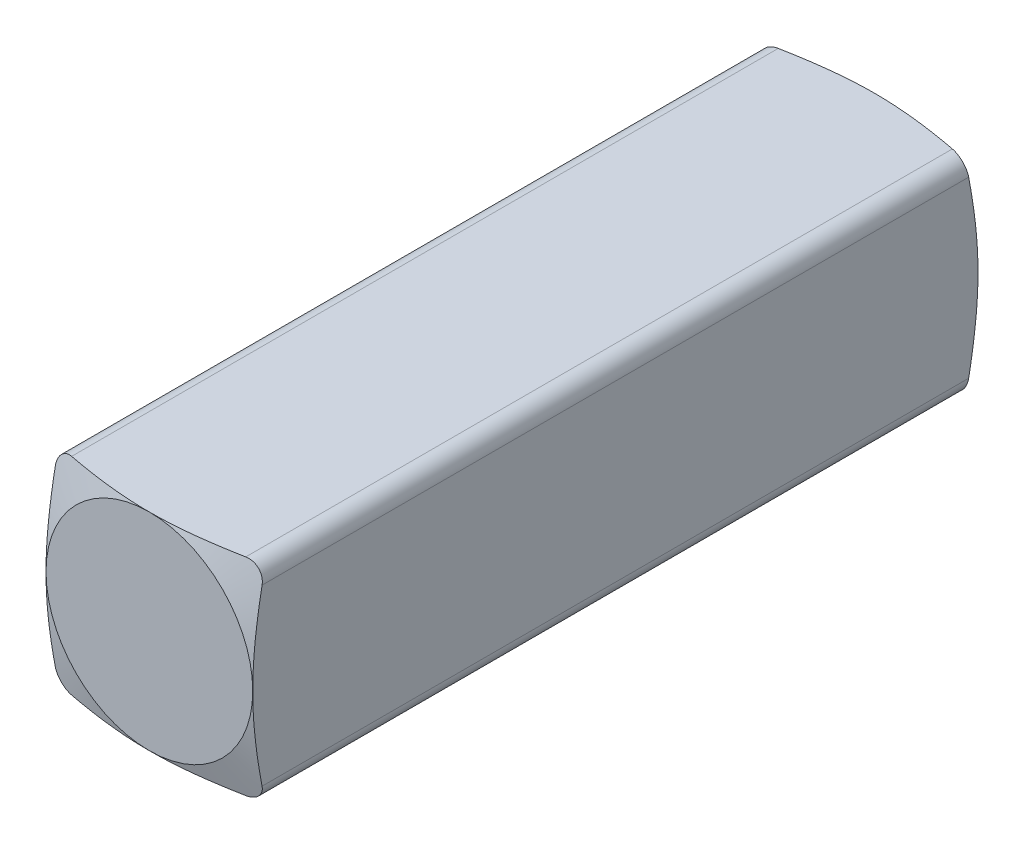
ISO-10303-21;
HEADER;
FILE_DESCRIPTION(('STEP AP214'),'2;1');
FILE_NAME('part.step','',(''),(''),'','','');
FILE_SCHEMA(('AUTOMOTIVE_DESIGN { 1 0 10303 214 1 1 1 1 }'));
ENDSEC;
DATA;
#1=APPLICATION_CONTEXT('core data for automotive mechanical design processes');
#2=APPLICATION_PROTOCOL_DEFINITION('international standard','automotive_design',2000,#1);
#3=PRODUCT_CONTEXT('',#1,'mechanical');
#4=PRODUCT('Part','Part','',(#3));
#5=PRODUCT_RELATED_PRODUCT_CATEGORY('part','',(#4));
#6=PRODUCT_DEFINITION_FORMATION('','',#4);
#7=PRODUCT_DEFINITION_CONTEXT('part definition',#1,'design');
#8=PRODUCT_DEFINITION('design','',#6,#7);
#9=PRODUCT_DEFINITION_SHAPE('','',#8);
#10=(LENGTH_UNIT() NAMED_UNIT(*) SI_UNIT(.MILLI.,.METRE.));
#11=(NAMED_UNIT(*) PLANE_ANGLE_UNIT() SI_UNIT($,.RADIAN.));
#12=(NAMED_UNIT(*) SI_UNIT($,.STERADIAN.) SOLID_ANGLE_UNIT());
#13=UNCERTAINTY_MEASURE_WITH_UNIT(LENGTH_MEASURE(1.E-05),#10,'distance_accuracy_value','');
#14=(GEOMETRIC_REPRESENTATION_CONTEXT(3) GLOBAL_UNCERTAINTY_ASSIGNED_CONTEXT((#13)) GLOBAL_UNIT_ASSIGNED_CONTEXT((#10,
#11,#12)) REPRESENTATION_CONTEXT('',''));
#15=CARTESIAN_POINT('',(0.,0.,0.));
#16=DIRECTION('',(0.,0.,1.));
#17=DIRECTION('',(1.,0.,0.));
#18=AXIS2_PLACEMENT_3D('',#15,#16,#17);
#19=CARTESIAN_POINT('',(-1.53487723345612,-1.585,5.56));
#20=DIRECTION('',(1.,0.,0.));
#21=DIRECTION('',(0.,1.,0.));
#22=AXIS2_PLACEMENT_3D('',#19,#20,#21);
#23=PLANE('',#22);
#24=CARTESIAN_POINT('',(-1.53487723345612,-3.1666652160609,-4.98590212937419));
#25=CARTESIAN_POINT('',(-1.53487723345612,-3.08469064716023,-5.00741349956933));
#26=CARTESIAN_POINT('',(-1.53487723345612,-3.0026760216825,-5.02877253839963));
#27=CARTESIAN_POINT('',(-1.53487723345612,-2.83854664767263,-5.07110881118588));
#28=CARTESIAN_POINT('',(-1.53487723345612,-2.75643189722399,-5.09208603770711));
#29=CARTESIAN_POINT('',(-1.53487723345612,-2.50995900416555,-5.15431622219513));
#30=CARTESIAN_POINT('',(-1.53487723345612,-2.34542557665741,-5.19488001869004));
#31=CARTESIAN_POINT('',(-1.53487723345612,-2.01672815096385,-5.27291274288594));
#32=CARTESIAN_POINT('',(-1.53487723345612,-1.85256851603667,-5.31039979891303));
#33=CARTESIAN_POINT('',(-1.53487723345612,-1.52315459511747,-5.38088405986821));
#34=CARTESIAN_POINT('',(-1.53487723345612,-1.3578996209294,-5.41387809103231));
#35=CARTESIAN_POINT('',(-1.53487723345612,-1.02346692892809,-5.47285926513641));
#36=CARTESIAN_POINT('',(-1.53487723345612,-0.854267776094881,-5.49873220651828));
#37=CARTESIAN_POINT('',(-1.53487723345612,-0.599515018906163,-5.52835962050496));
#38=CARTESIAN_POINT('',(-1.53487723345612,-0.514501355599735,-5.53670232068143));
#39=CARTESIAN_POINT('',(-1.53487723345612,-0.344193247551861,-5.54976964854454));
#40=CARTESIAN_POINT('',(-1.53487723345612,-0.258898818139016,-5.55449447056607));
#41=CARTESIAN_POINT('',(-1.53487723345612,-0.087766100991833,-5.55995909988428));
#42=CARTESIAN_POINT('',(-1.53487723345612,-0.00192717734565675,-5.56067953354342));
#43=CARTESIAN_POINT('',(-1.53487723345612,0.169686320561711,-5.55801863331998));
#44=CARTESIAN_POINT('',(-1.53487723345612,0.255460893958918,-5.55463724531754));
#45=CARTESIAN_POINT('',(-1.53487723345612,0.426896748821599,-5.54405364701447));
#46=CARTESIAN_POINT('',(-1.53487723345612,0.512557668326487,-5.53684572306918));
#47=CARTESIAN_POINT('',(-1.53487723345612,0.68353110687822,-5.51913338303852));
#48=CARTESIAN_POINT('',(-1.53487723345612,0.768843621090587,-5.50862892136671));
#49=CARTESIAN_POINT('',(-1.53487723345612,0.974055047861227,-5.48006689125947));
#50=CARTESIAN_POINT('',(-1.53487723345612,1.09376665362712,-5.46067915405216));
#51=CARTESIAN_POINT('',(-1.53487723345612,1.33251777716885,-5.41809303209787));
#52=CARTESIAN_POINT('',(-1.53487723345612,1.45155714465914,-5.39489382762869));
#53=CARTESIAN_POINT('',(-1.53487723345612,1.68916216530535,-5.34581473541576));
#54=CARTESIAN_POINT('',(-1.53487723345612,1.80772743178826,-5.31993299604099));
#55=CARTESIAN_POINT('',(-1.53487723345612,2.04441891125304,-5.26629444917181));
#56=CARTESIAN_POINT('',(-1.53487723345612,2.1625451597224,-5.23853779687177));
#57=CARTESIAN_POINT('',(-1.53487723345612,2.39875520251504,-5.18161334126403));
#58=CARTESIAN_POINT('',(-1.53487723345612,2.5168382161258,-5.15244231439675));
#59=CARTESIAN_POINT('',(-1.53487723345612,2.75275603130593,-5.09311121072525));
#60=CARTESIAN_POINT('',(-1.53487723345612,2.87059082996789,-5.06295112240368));
#61=CARTESIAN_POINT('',(-1.53487723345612,3.22371274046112,-4.97140632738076));
#62=CARTESIAN_POINT('',(-1.53487723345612,3.45871696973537,-4.90893257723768));
#63=CARTESIAN_POINT('',(-1.53487723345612,3.92636425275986,-4.78280087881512));
#64=CARTESIAN_POINT('',(-1.53487723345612,4.15901102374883,-4.71915660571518));
#65=CARTESIAN_POINT('',(-1.53487723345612,4.62403801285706,-4.5907856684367));
#66=CARTESIAN_POINT('',(-1.53487723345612,4.85641819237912,-4.52605886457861));
#67=CARTESIAN_POINT('',(-1.53487723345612,5.31976447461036,-4.39622957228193));
#68=CARTESIAN_POINT('',(-1.53487723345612,5.55073162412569,-4.33113081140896));
#69=CARTESIAN_POINT('',(-1.53487723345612,6.01248807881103,-4.20042948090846));
#70=CARTESIAN_POINT('',(-1.53487723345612,6.24327740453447,-4.13482698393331));
#71=CARTESIAN_POINT('',(-1.53487723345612,6.47402102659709,-4.06906552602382));
#72=B_SPLINE_CURVE_WITH_KNOTS('',3,(#24,#25,#26,#27,#28,#29,#30,#31,#32,#33,#34,#35,#36,#37,#38,
#39,#40,#41,#42,#43,#44,#45,#46,#47,#48,#49,#50,#51,#52,#53,#54,#55,#56,#57,#58,#59,#60,#61,#62,
#63,#64,#65,#66,#67,#68,#69,#70,#71),.UNSPECIFIED.,.F.,.F.,(4,2,2,2,2,2,2,2,2,2,2,2,2,2,2,2,2,2,
2,2,2,2,2,4),(0.,0.254249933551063,0.508504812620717,1.01686983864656,1.5219847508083,
2.02745463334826,2.54061232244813,2.79681427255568,3.05300245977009,3.31042903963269,
3.56785901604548,3.82567446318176,4.08349347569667,4.44721252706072,4.81100990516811,
5.17506008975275,5.53908017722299,5.90397296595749,6.26887000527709,6.998356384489,
7.72193914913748,8.44561600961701,9.16551335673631,9.8853087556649),.UNSPECIFIED.);
#73=CARTESIAN_POINT('',(-1.53487723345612,0.,-5.56));
#74=VERTEX_POINT('',#73);
#75=CARTESIAN_POINT('',(-1.53487723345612,-1.335,-5.41698643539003));
#76=VERTEX_POINT('',#75);
#77=EDGE_CURVE('E130',#74,#76,#72,.F.);
#78=ORIENTED_EDGE('',*,*,#77,.T.);
#79=DIRECTION('',(0.,0.,-1.));
#80=VECTOR('',#79,1.);
#81=CARTESIAN_POINT('',(-1.53487723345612,-1.335,5.56));
#82=LINE('',#81,#80);
#83=CARTESIAN_POINT('',(-1.53487723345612,-1.335,5.41698643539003));
#84=VERTEX_POINT('',#83);
#85=EDGE_CURVE('E60',#76,#84,#82,.F.);
#86=ORIENTED_EDGE('',*,*,#85,.T.);
#87=CARTESIAN_POINT('',(-1.53487723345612,-3.1666652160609,4.98590212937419));
#88=CARTESIAN_POINT('',(-1.53487723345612,-3.08469064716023,5.00741349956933));
#89=CARTESIAN_POINT('',(-1.53487723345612,-3.0026760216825,5.02877253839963));
#90=CARTESIAN_POINT('',(-1.53487723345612,-2.83854664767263,5.07110881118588));
#91=CARTESIAN_POINT('',(-1.53487723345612,-2.75643189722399,5.09208603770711));
#92=CARTESIAN_POINT('',(-1.53487723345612,-2.50995900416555,5.15431622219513));
#93=CARTESIAN_POINT('',(-1.53487723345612,-2.34542557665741,5.19488001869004));
#94=CARTESIAN_POINT('',(-1.53487723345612,-2.01672815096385,5.27291274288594));
#95=CARTESIAN_POINT('',(-1.53487723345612,-1.85256851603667,5.31039979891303));
#96=CARTESIAN_POINT('',(-1.53487723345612,-1.52315459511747,5.38088405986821));
#97=CARTESIAN_POINT('',(-1.53487723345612,-1.3578996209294,5.41387809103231));
#98=CARTESIAN_POINT('',(-1.53487723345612,-1.02346692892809,5.47285926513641));
#99=CARTESIAN_POINT('',(-1.53487723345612,-0.854267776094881,5.49873220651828));
#100=CARTESIAN_POINT('',(-1.53487723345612,-0.599515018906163,5.52835962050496));
#101=CARTESIAN_POINT('',(-1.53487723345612,-0.514501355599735,5.53670232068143));
#102=CARTESIAN_POINT('',(-1.53487723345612,-0.344193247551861,5.54976964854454));
#103=CARTESIAN_POINT('',(-1.53487723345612,-0.258898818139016,5.55449447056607));
#104=CARTESIAN_POINT('',(-1.53487723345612,-0.087766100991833,5.55995909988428));
#105=CARTESIAN_POINT('',(-1.53487723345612,-0.00192717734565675,5.56067953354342));
#106=CARTESIAN_POINT('',(-1.53487723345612,0.169686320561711,5.55801863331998));
#107=CARTESIAN_POINT('',(-1.53487723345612,0.255460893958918,5.55463724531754));
#108=CARTESIAN_POINT('',(-1.53487723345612,0.426896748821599,5.54405364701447));
#109=CARTESIAN_POINT('',(-1.53487723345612,0.512557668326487,5.53684572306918));
#110=CARTESIAN_POINT('',(-1.53487723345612,0.68353110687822,5.51913338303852));
#111=CARTESIAN_POINT('',(-1.53487723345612,0.768843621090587,5.50862892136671));
#112=CARTESIAN_POINT('',(-1.53487723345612,0.974055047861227,5.48006689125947));
#113=CARTESIAN_POINT('',(-1.53487723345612,1.09376665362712,5.46067915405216));
#114=CARTESIAN_POINT('',(-1.53487723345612,1.33251777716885,5.41809303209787));
#115=CARTESIAN_POINT('',(-1.53487723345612,1.45155714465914,5.39489382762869));
#116=CARTESIAN_POINT('',(-1.53487723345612,1.68916216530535,5.34581473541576));
#117=CARTESIAN_POINT('',(-1.53487723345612,1.80772743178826,5.31993299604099));
#118=CARTESIAN_POINT('',(-1.53487723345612,2.04441891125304,5.26629444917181));
#119=CARTESIAN_POINT('',(-1.53487723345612,2.1625451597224,5.23853779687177));
#120=CARTESIAN_POINT('',(-1.53487723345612,2.39875520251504,5.18161334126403));
#121=CARTESIAN_POINT('',(-1.53487723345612,2.5168382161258,5.15244231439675));
#122=CARTESIAN_POINT('',(-1.53487723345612,2.75275603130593,5.09311121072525));
#123=CARTESIAN_POINT('',(-1.53487723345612,2.87059082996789,5.06295112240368));
#124=CARTESIAN_POINT('',(-1.53487723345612,3.22371274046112,4.97140632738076));
#125=CARTESIAN_POINT('',(-1.53487723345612,3.45871696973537,4.90893257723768));
#126=CARTESIAN_POINT('',(-1.53487723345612,3.92636425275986,4.78280087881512));
#127=CARTESIAN_POINT('',(-1.53487723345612,4.15901102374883,4.71915660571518));
#128=CARTESIAN_POINT('',(-1.53487723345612,4.62403801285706,4.5907856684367));
#129=CARTESIAN_POINT('',(-1.53487723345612,4.85641819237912,4.52605886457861));
#130=CARTESIAN_POINT('',(-1.53487723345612,5.31976447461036,4.39622957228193));
#131=CARTESIAN_POINT('',(-1.53487723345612,5.55073162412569,4.33113081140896));
#132=CARTESIAN_POINT('',(-1.53487723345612,6.01248807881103,4.20042948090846));
#133=CARTESIAN_POINT('',(-1.53487723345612,6.24327740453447,4.13482698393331));
#134=CARTESIAN_POINT('',(-1.53487723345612,6.47402102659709,4.06906552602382));
#135=B_SPLINE_CURVE_WITH_KNOTS('',3,(#87,#88,#89,#90,#91,#92,#93,#94,#95,#96,#97,#98,#99,#100,
#101,#102,#103,#104,#105,#106,#107,#108,#109,#110,#111,#112,#113,#114,#115,#116,#117,#118,#119,
#120,#121,#122,#123,#124,#125,#126,#127,#128,#129,#130,#131,#132,#133,#134),.UNSPECIFIED.,.F.,
.F.,(4,2,2,2,2,2,2,2,2,2,2,2,2,2,2,2,2,2,2,2,2,2,2,4),(0.,0.254249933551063,0.508504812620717,
1.01686983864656,1.5219847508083,2.02745463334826,2.54061232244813,2.79681427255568,
3.05300245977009,3.31042903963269,3.56785901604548,3.82567446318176,4.08349347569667,
4.44721252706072,4.81100990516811,5.17506008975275,5.53908017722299,5.90397296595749,
6.26887000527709,6.998356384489,7.72193914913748,8.44561600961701,9.16551335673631,
9.8853087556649),.UNSPECIFIED.);
#136=CARTESIAN_POINT('',(-1.53487723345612,0.,5.56));
#137=VERTEX_POINT('',#136);
#138=EDGE_CURVE('E457',#84,#137,#135,.T.);
#139=ORIENTED_EDGE('',*,*,#138,.T.);
#140=CARTESIAN_POINT('',(-1.53487723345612,1.33500000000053,5.41698643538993));
#141=VERTEX_POINT('',#140);
#142=EDGE_CURVE('E191',#137,#141,#135,.T.);
#143=ORIENTED_EDGE('',*,*,#142,.T.);
#144=DIRECTION('',(0.,0.,-1.));
#145=VECTOR('',#144,1.);
#146=CARTESIAN_POINT('',(-1.53487723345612,1.335,5.56));
#147=LINE('',#146,#145);
#148=CARTESIAN_POINT('',(-1.53487723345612,1.33500000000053,-5.41698643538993));
#149=VERTEX_POINT('',#148);
#150=EDGE_CURVE('E132',#141,#149,#147,.T.);
#151=ORIENTED_EDGE('',*,*,#150,.T.);
#152=EDGE_CURVE('E128',#149,#74,#72,.F.);
#153=ORIENTED_EDGE('',*,*,#152,.T.);
#154=EDGE_LOOP('',(#78,#86,#139,#143,#151,#153));
#155=FACE_BOUND('',#154,.T.);
#156=ADVANCED_FACE('F34',(#155),#23,.F.);
#157=CARTESIAN_POINT('',(-1.53487723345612,-1.585,5.56));
#158=DIRECTION('',(0.,1.,0.));
#159=DIRECTION('',(-1.,0.,0.));
#160=AXIS2_PLACEMENT_3D('',#157,#158,#159);
#161=PLANE('',#160);
#162=CARTESIAN_POINT('',(-3.11654636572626,-1.585,-4.98590110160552));
#163=CARTESIAN_POINT('',(-3.03457163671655,-1.585,-5.00741251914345));
#164=CARTESIAN_POINT('',(-2.95255685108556,-1.585,-5.02877160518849));
#165=CARTESIAN_POINT('',(-2.78842715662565,-1.585,-5.07110797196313));
#166=CARTESIAN_POINT('',(-2.70631224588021,-1.585,-5.092085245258));
#167=CARTESIAN_POINT('',(-2.45983887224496,-1.585,-5.1543155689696));
#168=CARTESIAN_POINT('',(-2.29530512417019,-1.585,-5.19487945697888));
#169=CARTESIAN_POINT('',(-1.96660706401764,-1.585,-5.27291235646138));
#170=CARTESIAN_POINT('',(-1.80244711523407,-1.585,-5.31039949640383));
#171=CARTESIAN_POINT('',(-1.4730325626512,-1.585,-5.38088391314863));
#172=CARTESIAN_POINT('',(-1.30777727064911,-1.585,-5.41387801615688));
#173=CARTESIAN_POINT('',(-0.973343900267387,-1.585,-5.47285931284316));
#174=CARTESIAN_POINT('',(-0.804144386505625,-1.585,-5.49873230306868));
#175=CARTESIAN_POINT('',(-0.549391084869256,-1.585,-5.5283597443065));
#176=CARTESIAN_POINT('',(-0.464377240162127,-1.585,-5.53670244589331));
#177=CARTESIAN_POINT('',(-0.294068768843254,-1.585,-5.54976975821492));
#178=CARTESIAN_POINT('',(-0.208774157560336,-1.585,-5.55449456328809));
#179=CARTESIAN_POINT('',(-0.0376410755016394,-1.585,-5.55995913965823));
#180=CARTESIAN_POINT('',(0.0481980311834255,-1.585,-5.56067953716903));
#181=CARTESIAN_POINT('',(0.219811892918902,-1.585,-5.55801854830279));
#182=CARTESIAN_POINT('',(0.305586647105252,-1.585,-5.55463710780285));
#183=CARTESIAN_POINT('',(0.477022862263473,-1.585,-5.54405339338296));
#184=CARTESIAN_POINT('',(0.562683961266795,-1.585,-5.53684540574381));
#185=CARTESIAN_POINT('',(0.733657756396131,-1.585,-5.51913293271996));
#186=CARTESIAN_POINT('',(0.818970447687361,-1.585,-5.5086284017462));
#187=CARTESIAN_POINT('',(1.02418204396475,-1.585,-5.48006623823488));
#188=CARTESIAN_POINT('',(1.14389364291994,-1.585,-5.46067844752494));
#189=CARTESIAN_POINT('',(1.38264475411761,-1.585,-5.41809223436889));
#190=CARTESIAN_POINT('',(1.50168411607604,-1.585,-5.39489299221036));
#191=CARTESIAN_POINT('',(1.73928912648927,-1.585,-5.34581383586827));
#192=CARTESIAN_POINT('',(1.85785438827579,-1.585,-5.31993207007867));
#193=CARTESIAN_POINT('',(2.09454585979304,-1.585,-5.26629347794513));
#194=CARTESIAN_POINT('',(2.21267210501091,-1.585,-5.23853680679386));
#195=CARTESIAN_POINT('',(2.44888213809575,-1.585,-5.18161231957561));
#196=CARTESIAN_POINT('',(2.56696514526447,-1.585,-5.15244128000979));
#197=CARTESIAN_POINT('',(2.80288294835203,-1.585,-5.09311015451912));
#198=CARTESIAN_POINT('',(2.92071774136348,-1.585,-5.06295005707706));
#199=CARTESIAN_POINT('',(3.27383963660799,-1.585,-4.97140523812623));
#200=CARTESIAN_POINT('',(3.50884385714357,-1.585,-4.90893147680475));
#201=CARTESIAN_POINT('',(3.97649110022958,-1.585,-4.78279976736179));
#202=CARTESIAN_POINT('',(4.20913784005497,-1.585,-4.71915549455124));
#203=CARTESIAN_POINT('',(4.67416476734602,-1.585,-4.59078456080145));
#204=CARTESIAN_POINT('',(4.9065449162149,-1.585,-4.52605776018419));
#205=CARTESIAN_POINT('',(5.36989115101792,-1.585,-4.39622847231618));
#206=CARTESIAN_POINT('',(5.60085828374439,-1.585,-4.33112971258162));
#207=CARTESIAN_POINT('',(6.06261470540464,-1.585,-4.2004283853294));
#208=CARTESIAN_POINT('',(6.29340401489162,-1.585,-4.13482589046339));
#209=CARTESIAN_POINT('',(6.52414762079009,-1.585,-4.06906443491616));
#210=B_SPLINE_CURVE_WITH_KNOTS('',3,(#162,#163,#164,#165,#166,#167,#168,#169,#170,#171,#172,
#173,#174,#175,#176,#177,#178,#179,#180,#181,#182,#183,#184,#185,#186,#187,#188,#189,#190,#191,
#192,#193,#194,#195,#196,#197,#198,#199,#200,#201,#202,#203,#204,#205,#206,#207,#208,#209),
.UNSPECIFIED.,.F.,.F.,(4,2,2,2,2,2,2,2,2,2,2,2,2,2,2,2,2,2,2,2,2,2,2,4),(0.,0.254250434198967,
0.508505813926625,1.0168718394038,1.52198772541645,2.02745858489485,2.54061736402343,
2.79681985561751,3.05300858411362,3.31043571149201,3.56786623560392,3.82568223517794,
4.08350180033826,4.44722085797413,4.81101824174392,5.17506842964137,5.53908852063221,
5.90398129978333,6.26887832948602,6.99836469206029,7.72194736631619,8.44562413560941,
9.16552143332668,9.88531678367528),.UNSPECIFIED.);
#211=CARTESIAN_POINT('',(0.0501227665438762,-1.585,-5.56));
#212=VERTEX_POINT('',#211);
#213=CARTESIAN_POINT('',(1.38512276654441,-1.585,-5.41698643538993));
#214=VERTEX_POINT('',#213);
#215=EDGE_CURVE('E212',#212,#214,#210,.T.);
#216=ORIENTED_EDGE('',*,*,#215,.T.);
#217=DIRECTION('',(0.,0.,-1.));
#218=VECTOR('',#217,1.);
#219=CARTESIAN_POINT('',(1.38512276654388,-1.585,5.56));
#220=LINE('',#219,#218);
#221=CARTESIAN_POINT('',(1.38512276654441,-1.585,5.41698643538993));
#222=VERTEX_POINT('',#221);
#223=EDGE_CURVE('E430',#214,#222,#220,.F.);
#224=ORIENTED_EDGE('',*,*,#223,.T.);
#225=CARTESIAN_POINT('',(-3.11654636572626,-1.585,4.98590110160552));
#226=CARTESIAN_POINT('',(-3.03457163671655,-1.585,5.00741251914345));
#227=CARTESIAN_POINT('',(-2.95255685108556,-1.585,5.02877160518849));
#228=CARTESIAN_POINT('',(-2.78842715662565,-1.585,5.07110797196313));
#229=CARTESIAN_POINT('',(-2.70631224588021,-1.585,5.092085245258));
#230=CARTESIAN_POINT('',(-2.45983887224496,-1.585,5.1543155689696));
#231=CARTESIAN_POINT('',(-2.29530512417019,-1.585,5.19487945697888));
#232=CARTESIAN_POINT('',(-1.96660706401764,-1.585,5.27291235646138));
#233=CARTESIAN_POINT('',(-1.80244711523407,-1.585,5.31039949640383));
#234=CARTESIAN_POINT('',(-1.4730325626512,-1.585,5.38088391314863));
#235=CARTESIAN_POINT('',(-1.30777727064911,-1.585,5.41387801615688));
#236=CARTESIAN_POINT('',(-0.973343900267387,-1.585,5.47285931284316));
#237=CARTESIAN_POINT('',(-0.804144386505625,-1.585,5.49873230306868));
#238=CARTESIAN_POINT('',(-0.549391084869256,-1.585,5.5283597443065));
#239=CARTESIAN_POINT('',(-0.464377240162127,-1.585,5.53670244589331));
#240=CARTESIAN_POINT('',(-0.294068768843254,-1.585,5.54976975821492));
#241=CARTESIAN_POINT('',(-0.208774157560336,-1.585,5.55449456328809));
#242=CARTESIAN_POINT('',(-0.0376410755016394,-1.585,5.55995913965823));
#243=CARTESIAN_POINT('',(0.0481980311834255,-1.585,5.56067953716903));
#244=CARTESIAN_POINT('',(0.219811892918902,-1.585,5.55801854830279));
#245=CARTESIAN_POINT('',(0.305586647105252,-1.585,5.55463710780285));
#246=CARTESIAN_POINT('',(0.477022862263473,-1.585,5.54405339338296));
#247=CARTESIAN_POINT('',(0.562683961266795,-1.585,5.53684540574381));
#248=CARTESIAN_POINT('',(0.733657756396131,-1.585,5.51913293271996));
#249=CARTESIAN_POINT('',(0.818970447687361,-1.585,5.5086284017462));
#250=CARTESIAN_POINT('',(1.02418204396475,-1.585,5.48006623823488));
#251=CARTESIAN_POINT('',(1.14389364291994,-1.585,5.46067844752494));
#252=CARTESIAN_POINT('',(1.38264475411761,-1.585,5.41809223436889));
#253=CARTESIAN_POINT('',(1.50168411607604,-1.585,5.39489299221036));
#254=CARTESIAN_POINT('',(1.73928912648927,-1.585,5.34581383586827));
#255=CARTESIAN_POINT('',(1.85785438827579,-1.585,5.31993207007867));
#256=CARTESIAN_POINT('',(2.09454585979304,-1.585,5.26629347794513));
#257=CARTESIAN_POINT('',(2.21267210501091,-1.585,5.23853680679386));
#258=CARTESIAN_POINT('',(2.44888213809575,-1.585,5.18161231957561));
#259=CARTESIAN_POINT('',(2.56696514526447,-1.585,5.15244128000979));
#260=CARTESIAN_POINT('',(2.80288294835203,-1.585,5.09311015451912));
#261=CARTESIAN_POINT('',(2.92071774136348,-1.585,5.06295005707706));
#262=CARTESIAN_POINT('',(3.27383963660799,-1.585,4.97140523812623));
#263=CARTESIAN_POINT('',(3.50884385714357,-1.585,4.90893147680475));
#264=CARTESIAN_POINT('',(3.97649110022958,-1.585,4.78279976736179));
#265=CARTESIAN_POINT('',(4.20913784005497,-1.585,4.71915549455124));
#266=CARTESIAN_POINT('',(4.67416476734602,-1.585,4.59078456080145));
#267=CARTESIAN_POINT('',(4.9065449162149,-1.585,4.52605776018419));
#268=CARTESIAN_POINT('',(5.36989115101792,-1.585,4.39622847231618));
#269=CARTESIAN_POINT('',(5.60085828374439,-1.585,4.33112971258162));
#270=CARTESIAN_POINT('',(6.06261470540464,-1.585,4.2004283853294));
#271=CARTESIAN_POINT('',(6.29340401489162,-1.585,4.13482589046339));
#272=CARTESIAN_POINT('',(6.52414762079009,-1.585,4.06906443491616));
#273=B_SPLINE_CURVE_WITH_KNOTS('',3,(#225,#226,#227,#228,#229,#230,#231,#232,#233,#234,#235,
#236,#237,#238,#239,#240,#241,#242,#243,#244,#245,#246,#247,#248,#249,#250,#251,#252,#253,#254,
#255,#256,#257,#258,#259,#260,#261,#262,#263,#264,#265,#266,#267,#268,#269,#270,#271,#272),
.UNSPECIFIED.,.F.,.F.,(4,2,2,2,2,2,2,2,2,2,2,2,2,2,2,2,2,2,2,2,2,2,2,4),(0.,0.254250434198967,
0.508505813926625,1.0168718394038,1.52198772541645,2.02745858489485,2.54061736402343,
2.79681985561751,3.05300858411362,3.31043571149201,3.56786623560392,3.82568223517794,
4.08350180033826,4.44722085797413,4.81101824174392,5.17506842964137,5.53908852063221,
5.90398129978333,6.26887832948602,6.99836469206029,7.72194736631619,8.44562413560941,
9.16552143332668,9.88531678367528),.UNSPECIFIED.);
#274=CARTESIAN_POINT('',(0.0501227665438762,-1.585,5.56));
#275=VERTEX_POINT('',#274);
#276=EDGE_CURVE('E178',#222,#275,#273,.F.);
#277=ORIENTED_EDGE('',*,*,#276,.T.);
#278=CARTESIAN_POINT('',(-1.28487723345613,-1.585,5.41698643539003));
#279=VERTEX_POINT('',#278);
#280=EDGE_CURVE('E180',#275,#279,#273,.F.);
#281=ORIENTED_EDGE('',*,*,#280,.T.);
#282=DIRECTION('',(0.,0.,-1.));
#283=VECTOR('',#282,1.);
#284=CARTESIAN_POINT('',(-1.28487723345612,-1.585,5.56));
#285=LINE('',#284,#283);
#286=CARTESIAN_POINT('',(-1.28487723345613,-1.585,-5.41698643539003));
#287=VERTEX_POINT('',#286);
#288=EDGE_CURVE('E435',#279,#287,#285,.T.);
#289=ORIENTED_EDGE('',*,*,#288,.T.);
#290=EDGE_CURVE('E145',#287,#212,#210,.T.);
#291=ORIENTED_EDGE('',*,*,#290,.T.);
#292=EDGE_LOOP('',(#216,#224,#277,#281,#289,#291));
#293=FACE_BOUND('',#292,.T.);
#294=ADVANCED_FACE('F201',(#293),#161,.F.);
#295=CARTESIAN_POINT('',(1.63512276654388,-1.585,5.56));
#296=DIRECTION('',(-1.,0.,0.));
#297=DIRECTION('',(0.,-1.,0.));
#298=AXIS2_PLACEMENT_3D('',#295,#296,#297);
#299=PLANE('',#298);
#300=CARTESIAN_POINT('',(1.63512276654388,-3.16666913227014,-4.98590110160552));
#301=CARTESIAN_POINT('',(1.63512276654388,-3.08469440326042,-5.00741251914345));
#302=CARTESIAN_POINT('',(1.63512276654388,-3.00267961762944,-5.02877160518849));
#303=CARTESIAN_POINT('',(1.63512276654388,-2.83854992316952,-5.07110797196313));
#304=CARTESIAN_POINT('',(1.63512276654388,-2.75643501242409,-5.092085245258));
#305=CARTESIAN_POINT('',(1.63512276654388,-2.50996163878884,-5.1543155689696));
#306=CARTESIAN_POINT('',(1.63512276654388,-2.34542789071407,-5.19487945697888));
#307=CARTESIAN_POINT('',(1.63512276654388,-2.01672983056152,-5.27291235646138));
#308=CARTESIAN_POINT('',(1.63512276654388,-1.85256988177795,-5.31039949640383));
#309=CARTESIAN_POINT('',(1.63512276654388,-1.52315532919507,-5.38088391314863));
#310=CARTESIAN_POINT('',(1.63512276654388,-1.35790003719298,-5.41387801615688));
#311=CARTESIAN_POINT('',(1.63512276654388,-1.02346666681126,-5.47285931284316));
#312=CARTESIAN_POINT('',(1.63512276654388,-0.854267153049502,-5.49873230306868));
#313=CARTESIAN_POINT('',(1.63512276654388,-0.599513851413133,-5.5283597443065));
#314=CARTESIAN_POINT('',(1.63512276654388,-0.514500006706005,-5.53670244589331));
#315=CARTESIAN_POINT('',(1.63512276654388,-0.344191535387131,-5.54976975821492));
#316=CARTESIAN_POINT('',(1.63512276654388,-0.258896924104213,-5.55449456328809));
#317=CARTESIAN_POINT('',(1.63512276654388,-0.0877638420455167,-5.55995913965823));
#318=CARTESIAN_POINT('',(1.63512276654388,-0.00192473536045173,-5.56067953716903));
#319=CARTESIAN_POINT('',(1.63512276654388,0.169689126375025,-5.55801854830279));
#320=CARTESIAN_POINT('',(1.63512276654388,0.255463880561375,-5.55463710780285));
#321=CARTESIAN_POINT('',(1.63512276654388,0.426900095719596,-5.54405339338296));
#322=CARTESIAN_POINT('',(1.63512276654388,0.512561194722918,-5.53684540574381));
#323=CARTESIAN_POINT('',(1.63512276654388,0.683534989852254,-5.51913293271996));
#324=CARTESIAN_POINT('',(1.63512276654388,0.768847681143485,-5.5086284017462));
#325=CARTESIAN_POINT('',(1.63512276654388,0.974059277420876,-5.48006623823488));
#326=CARTESIAN_POINT('',(1.63512276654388,1.09377087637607,-5.46067844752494));
#327=CARTESIAN_POINT('',(1.63512276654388,1.33252198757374,-5.41809223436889));
#328=CARTESIAN_POINT('',(1.63512276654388,1.45156134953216,-5.39489299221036));
#329=CARTESIAN_POINT('',(1.63512276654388,1.68916635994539,-5.34581383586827));
#330=CARTESIAN_POINT('',(1.63512276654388,1.80773162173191,-5.31993207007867));
#331=CARTESIAN_POINT('',(1.63512276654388,2.04442309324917,-5.26629347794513));
#332=CARTESIAN_POINT('',(1.63512276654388,2.16254933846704,-5.23853680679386));
#333=CARTESIAN_POINT('',(1.63512276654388,2.39875937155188,-5.18161231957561));
#334=CARTESIAN_POINT('',(1.63512276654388,2.5168423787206,-5.15244128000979));
#335=CARTESIAN_POINT('',(1.63512276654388,2.75276018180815,-5.09311015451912));
#336=CARTESIAN_POINT('',(1.63512276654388,2.8705949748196,-5.06295005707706));
#337=CARTESIAN_POINT('',(1.63512276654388,3.22371687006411,-4.97140523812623));
#338=CARTESIAN_POINT('',(1.63512276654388,3.4587210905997,-4.90893147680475));
#339=CARTESIAN_POINT('',(1.63512276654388,3.92636833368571,-4.78279976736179));
#340=CARTESIAN_POINT('',(1.63512276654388,4.1590150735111,-4.71915549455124));
#341=CARTESIAN_POINT('',(1.63512276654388,4.62404200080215,-4.59078456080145));
#342=CARTESIAN_POINT('',(1.63512276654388,4.85642214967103,-4.52605776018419));
#343=CARTESIAN_POINT('',(1.63512276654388,5.31976838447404,-4.39622847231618));
#344=CARTESIAN_POINT('',(1.63512276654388,5.55073551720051,-4.33112971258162));
#345=CARTESIAN_POINT('',(1.63512276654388,6.01249193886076,-4.2004283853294));
#346=CARTESIAN_POINT('',(1.63512276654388,6.24328124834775,-4.13482589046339));
#347=CARTESIAN_POINT('',(1.63512276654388,6.47402485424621,-4.06906443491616));
#348=B_SPLINE_CURVE_WITH_KNOTS('',3,(#300,#301,#302,#303,#304,#305,#306,#307,#308,#309,#310,
#311,#312,#313,#314,#315,#316,#317,#318,#319,#320,#321,#322,#323,#324,#325,#326,#327,#328,#329,
#330,#331,#332,#333,#334,#335,#336,#337,#338,#339,#340,#341,#342,#343,#344,#345,#346,#347),
.UNSPECIFIED.,.F.,.F.,(4,2,2,2,2,2,2,2,2,2,2,2,2,2,2,2,2,2,2,2,2,2,2,4),(0.,0.254250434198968,
0.508505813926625,1.0168718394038,1.52198772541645,2.02745858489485,2.54061736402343,
2.79681985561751,3.05300858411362,3.31043571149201,3.56786623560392,3.82568223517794,
4.08350180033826,4.44722085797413,4.81101824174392,5.17506842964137,5.53908852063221,
5.90398129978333,6.26887832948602,6.99836469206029,7.72194736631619,8.44562413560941,
9.16552143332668,9.88531678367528),.UNSPECIFIED.);
#349=CARTESIAN_POINT('',(1.63512276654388,0.,-5.56));
#350=VERTEX_POINT('',#349);
#351=CARTESIAN_POINT('',(1.63512276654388,1.33500000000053,-5.41698643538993));
#352=VERTEX_POINT('',#351);
#353=EDGE_CURVE('E219',#350,#352,#348,.T.);
#354=ORIENTED_EDGE('',*,*,#353,.T.);
#355=DIRECTION('',(0.,0.,-1.));
#356=VECTOR('',#355,1.);
#357=CARTESIAN_POINT('',(1.63512276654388,1.335,5.56));
#358=LINE('',#357,#356);
#359=CARTESIAN_POINT('',(1.63512276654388,1.33500000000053,5.41698643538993));
#360=VERTEX_POINT('',#359);
#361=EDGE_CURVE('E441',#352,#360,#358,.F.);
#362=ORIENTED_EDGE('',*,*,#361,.T.);
#363=CARTESIAN_POINT('',(1.63512276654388,-3.16666913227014,4.98590110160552));
#364=CARTESIAN_POINT('',(1.63512276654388,-3.08469440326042,5.00741251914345));
#365=CARTESIAN_POINT('',(1.63512276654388,-3.00267961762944,5.02877160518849));
#366=CARTESIAN_POINT('',(1.63512276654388,-2.83854992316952,5.07110797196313));
#367=CARTESIAN_POINT('',(1.63512276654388,-2.75643501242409,5.092085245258));
#368=CARTESIAN_POINT('',(1.63512276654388,-2.50996163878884,5.1543155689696));
#369=CARTESIAN_POINT('',(1.63512276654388,-2.34542789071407,5.19487945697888));
#370=CARTESIAN_POINT('',(1.63512276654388,-2.01672983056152,5.27291235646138));
#371=CARTESIAN_POINT('',(1.63512276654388,-1.85256988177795,5.31039949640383));
#372=CARTESIAN_POINT('',(1.63512276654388,-1.52315532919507,5.38088391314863));
#373=CARTESIAN_POINT('',(1.63512276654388,-1.35790003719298,5.41387801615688));
#374=CARTESIAN_POINT('',(1.63512276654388,-1.02346666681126,5.47285931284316));
#375=CARTESIAN_POINT('',(1.63512276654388,-0.854267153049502,5.49873230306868));
#376=CARTESIAN_POINT('',(1.63512276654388,-0.599513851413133,5.5283597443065));
#377=CARTESIAN_POINT('',(1.63512276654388,-0.514500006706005,5.53670244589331));
#378=CARTESIAN_POINT('',(1.63512276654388,-0.344191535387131,5.54976975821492));
#379=CARTESIAN_POINT('',(1.63512276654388,-0.258896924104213,5.55449456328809));
#380=CARTESIAN_POINT('',(1.63512276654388,-0.0877638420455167,5.55995913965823));
#381=CARTESIAN_POINT('',(1.63512276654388,-0.00192473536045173,5.56067953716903));
#382=CARTESIAN_POINT('',(1.63512276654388,0.169689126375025,5.55801854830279));
#383=CARTESIAN_POINT('',(1.63512276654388,0.255463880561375,5.55463710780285));
#384=CARTESIAN_POINT('',(1.63512276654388,0.426900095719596,5.54405339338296));
#385=CARTESIAN_POINT('',(1.63512276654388,0.512561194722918,5.53684540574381));
#386=CARTESIAN_POINT('',(1.63512276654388,0.683534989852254,5.51913293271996));
#387=CARTESIAN_POINT('',(1.63512276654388,0.768847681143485,5.5086284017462));
#388=CARTESIAN_POINT('',(1.63512276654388,0.974059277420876,5.48006623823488));
#389=CARTESIAN_POINT('',(1.63512276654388,1.09377087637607,5.46067844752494));
#390=CARTESIAN_POINT('',(1.63512276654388,1.33252198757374,5.41809223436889));
#391=CARTESIAN_POINT('',(1.63512276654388,1.45156134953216,5.39489299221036));
#392=CARTESIAN_POINT('',(1.63512276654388,1.68916635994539,5.34581383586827));
#393=CARTESIAN_POINT('',(1.63512276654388,1.80773162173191,5.31993207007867));
#394=CARTESIAN_POINT('',(1.63512276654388,2.04442309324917,5.26629347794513));
#395=CARTESIAN_POINT('',(1.63512276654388,2.16254933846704,5.23853680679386));
#396=CARTESIAN_POINT('',(1.63512276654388,2.39875937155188,5.18161231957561));
#397=CARTESIAN_POINT('',(1.63512276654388,2.5168423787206,5.15244128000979));
#398=CARTESIAN_POINT('',(1.63512276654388,2.75276018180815,5.09311015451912));
#399=CARTESIAN_POINT('',(1.63512276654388,2.8705949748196,5.06295005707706));
#400=CARTESIAN_POINT('',(1.63512276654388,3.22371687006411,4.97140523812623));
#401=CARTESIAN_POINT('',(1.63512276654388,3.4587210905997,4.90893147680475));
#402=CARTESIAN_POINT('',(1.63512276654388,3.92636833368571,4.78279976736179));
#403=CARTESIAN_POINT('',(1.63512276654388,4.1590150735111,4.71915549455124));
#404=CARTESIAN_POINT('',(1.63512276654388,4.62404200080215,4.59078456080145));
#405=CARTESIAN_POINT('',(1.63512276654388,4.85642214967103,4.52605776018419));
#406=CARTESIAN_POINT('',(1.63512276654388,5.31976838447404,4.39622847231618));
#407=CARTESIAN_POINT('',(1.63512276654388,5.55073551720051,4.33112971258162));
#408=CARTESIAN_POINT('',(1.63512276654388,6.01249193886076,4.2004283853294));
#409=CARTESIAN_POINT('',(1.63512276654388,6.24328124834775,4.13482589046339));
#410=CARTESIAN_POINT('',(1.63512276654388,6.47402485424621,4.06906443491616));
#411=B_SPLINE_CURVE_WITH_KNOTS('',3,(#363,#364,#365,#366,#367,#368,#369,#370,#371,#372,#373,
#374,#375,#376,#377,#378,#379,#380,#381,#382,#383,#384,#385,#386,#387,#388,#389,#390,#391,#392,
#393,#394,#395,#396,#397,#398,#399,#400,#401,#402,#403,#404,#405,#406,#407,#408,#409,#410),
.UNSPECIFIED.,.F.,.F.,(4,2,2,2,2,2,2,2,2,2,2,2,2,2,2,2,2,2,2,2,2,2,2,4),(0.,0.254250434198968,
0.508505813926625,1.0168718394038,1.52198772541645,2.02745858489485,2.54061736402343,
2.79681985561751,3.05300858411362,3.31043571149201,3.56786623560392,3.82568223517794,
4.08350180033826,4.44722085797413,4.81101824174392,5.17506842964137,5.53908852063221,
5.90398129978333,6.26887832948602,6.99836469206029,7.72194736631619,8.44562413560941,
9.16552143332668,9.88531678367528),.UNSPECIFIED.);
#412=CARTESIAN_POINT('',(1.63512276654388,0.,5.56));
#413=VERTEX_POINT('',#412);
#414=EDGE_CURVE('E455',#360,#413,#411,.F.);
#415=ORIENTED_EDGE('',*,*,#414,.T.);
#416=CARTESIAN_POINT('',(1.63512276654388,-1.335,5.41698643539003));
#417=VERTEX_POINT('',#416);
#418=EDGE_CURVE('E185',#413,#417,#411,.F.);
#419=ORIENTED_EDGE('',*,*,#418,.T.);
#420=DIRECTION('',(0.,0.,-1.));
#421=VECTOR('',#420,1.);
#422=CARTESIAN_POINT('',(1.63512276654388,-1.335,5.56));
#423=LINE('',#422,#421);
#424=CARTESIAN_POINT('',(1.63512276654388,-1.335,-5.41698643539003));
#425=VERTEX_POINT('',#424);
#426=EDGE_CURVE('E432',#417,#425,#423,.T.);
#427=ORIENTED_EDGE('',*,*,#426,.T.);
#428=EDGE_CURVE('E218',#425,#350,#348,.T.);
#429=ORIENTED_EDGE('',*,*,#428,.T.);
#430=EDGE_LOOP('',(#354,#362,#415,#419,#427,#429));
#431=FACE_BOUND('',#430,.T.);
#432=ADVANCED_FACE('F205',(#431),#299,.F.);
#433=CARTESIAN_POINT('',(-1.53487723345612,1.585,5.56));
#434=DIRECTION('',(0.,-1.,0.));
#435=DIRECTION('',(1.,0.,0.));
#436=AXIS2_PLACEMENT_3D('',#433,#434,#435);
#437=PLANE('',#436);
#438=CARTESIAN_POINT('',(-3.11654244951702,1.585,4.98590212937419));
#439=CARTESIAN_POINT('',(-3.03456788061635,1.585,5.00741349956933));
#440=CARTESIAN_POINT('',(-2.95255325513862,1.585,5.02877253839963));
#441=CARTESIAN_POINT('',(-2.78842388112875,1.585,5.07110881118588));
#442=CARTESIAN_POINT('',(-2.70630913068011,1.585,5.09208603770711));
#443=CARTESIAN_POINT('',(-2.45983623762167,1.585,5.15431622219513));
#444=CARTESIAN_POINT('',(-2.29530281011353,1.585,5.19488001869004));
#445=CARTESIAN_POINT('',(-1.96660538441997,1.585,5.27291274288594));
#446=CARTESIAN_POINT('',(-1.80244574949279,1.585,5.31039979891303));
#447=CARTESIAN_POINT('',(-1.47303182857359,1.585,5.38088405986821));
#448=CARTESIAN_POINT('',(-1.30777685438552,1.585,5.41387809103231));
#449=CARTESIAN_POINT('',(-0.973344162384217,1.585,5.47285926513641));
#450=CARTESIAN_POINT('',(-0.804145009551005,1.585,5.49873220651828));
#451=CARTESIAN_POINT('',(-0.549392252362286,1.585,5.52835962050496));
#452=CARTESIAN_POINT('',(-0.464378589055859,1.585,5.53670232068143));
#453=CARTESIAN_POINT('',(-0.294070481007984,1.585,5.54976964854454));
#454=CARTESIAN_POINT('',(-0.20877605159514,1.585,5.55449447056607));
#455=CARTESIAN_POINT('',(-0.0376433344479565,1.585,5.55995909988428));
#456=CARTESIAN_POINT('',(0.0481955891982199,1.585,5.56067953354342));
#457=CARTESIAN_POINT('',(0.219809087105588,1.585,5.55801863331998));
#458=CARTESIAN_POINT('',(0.305583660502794,1.585,5.55463724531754));
#459=CARTESIAN_POINT('',(0.477019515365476,1.585,5.54405364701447));
#460=CARTESIAN_POINT('',(0.562680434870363,1.585,5.53684572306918));
#461=CARTESIAN_POINT('',(0.733653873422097,1.585,5.51913338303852));
#462=CARTESIAN_POINT('',(0.818966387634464,1.585,5.50862892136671));
#463=CARTESIAN_POINT('',(1.0241778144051,1.585,5.48006689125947));
#464=CARTESIAN_POINT('',(1.143889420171,1.585,5.46067915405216));
#465=CARTESIAN_POINT('',(1.38264054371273,1.585,5.41809303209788));
#466=CARTESIAN_POINT('',(1.50167991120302,1.585,5.39489382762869));
#467=CARTESIAN_POINT('',(1.73928493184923,1.585,5.34581473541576));
#468=CARTESIAN_POINT('',(1.85785019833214,1.585,5.31993299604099));
#469=CARTESIAN_POINT('',(2.09454167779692,1.585,5.26629444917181));
#470=CARTESIAN_POINT('',(2.21266792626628,1.585,5.23853779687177));
#471=CARTESIAN_POINT('',(2.44887796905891,1.585,5.18161334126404));
#472=CARTESIAN_POINT('',(2.56696098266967,1.585,5.15244231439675));
#473=CARTESIAN_POINT('',(2.80287879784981,1.585,5.09311121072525));
#474=CARTESIAN_POINT('',(2.92071359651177,1.585,5.06295112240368));
#475=CARTESIAN_POINT('',(3.273835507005,1.585,4.97140632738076));
#476=CARTESIAN_POINT('',(3.50883973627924,1.585,4.90893257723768));
#477=CARTESIAN_POINT('',(3.97648701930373,1.585,4.78280087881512));
#478=CARTESIAN_POINT('',(4.20913379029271,1.585,4.71915660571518));
#479=CARTESIAN_POINT('',(4.67416077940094,1.585,4.5907856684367));
#480=CARTESIAN_POINT('',(4.906540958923,1.585,4.52605886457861));
#481=CARTESIAN_POINT('',(5.36988724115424,1.585,4.39622957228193));
#482=CARTESIAN_POINT('',(5.60085439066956,1.585,4.33113081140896));
#483=CARTESIAN_POINT('',(6.06261084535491,1.585,4.20042948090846));
#484=CARTESIAN_POINT('',(6.29340017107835,1.585,4.13482698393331));
#485=CARTESIAN_POINT('',(6.52414379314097,1.585,4.06906552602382));
#486=B_SPLINE_CURVE_WITH_KNOTS('',3,(#438,#439,#440,#441,#442,#443,#444,#445,#446,#447,#448,
#449,#450,#451,#452,#453,#454,#455,#456,#457,#458,#459,#460,#461,#462,#463,#464,#465,#466,#467,
#468,#469,#470,#471,#472,#473,#474,#475,#476,#477,#478,#479,#480,#481,#482,#483,#484,#485),
.UNSPECIFIED.,.F.,.F.,(4,2,2,2,2,2,2,2,2,2,2,2,2,2,2,2,2,2,2,2,2,2,2,4),(0.,0.254249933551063,
0.508504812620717,1.01686983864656,1.5219847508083,2.02745463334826,2.54061232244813,
2.79681427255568,3.05300245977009,3.31042903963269,3.56785901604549,3.82567446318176,
4.08349347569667,4.44721252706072,4.81100990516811,5.17506008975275,5.53908017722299,
5.90397296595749,6.26887000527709,6.998356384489,7.72193914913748,8.44561600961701,
9.16551335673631,9.8853087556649),.UNSPECIFIED.);
#487=CARTESIAN_POINT('',(0.0501227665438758,1.585,5.56));
#488=VERTEX_POINT('',#487);
#489=CARTESIAN_POINT('',(1.38512276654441,1.585,5.41698643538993));
#490=VERTEX_POINT('',#489);
#491=EDGE_CURVE('E453',#488,#490,#486,.T.);
#492=ORIENTED_EDGE('',*,*,#491,.T.);
#493=DIRECTION('',(0.,0.,-1.));
#494=VECTOR('',#493,1.);
#495=CARTESIAN_POINT('',(1.38512276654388,1.585,5.56));
#496=LINE('',#495,#494);
#497=CARTESIAN_POINT('',(1.38512276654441,1.585,-5.41698643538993));
#498=VERTEX_POINT('',#497);
#499=EDGE_CURVE('E161',#490,#498,#496,.T.);
#500=ORIENTED_EDGE('',*,*,#499,.T.);
#501=CARTESIAN_POINT('',(-3.11654244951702,1.585,-4.98590212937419));
#502=CARTESIAN_POINT('',(-3.03456788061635,1.585,-5.00741349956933));
#503=CARTESIAN_POINT('',(-2.95255325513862,1.585,-5.02877253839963));
#504=CARTESIAN_POINT('',(-2.78842388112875,1.585,-5.07110881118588));
#505=CARTESIAN_POINT('',(-2.70630913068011,1.585,-5.09208603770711));
#506=CARTESIAN_POINT('',(-2.45983623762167,1.585,-5.15431622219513));
#507=CARTESIAN_POINT('',(-2.29530281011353,1.585,-5.19488001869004));
#508=CARTESIAN_POINT('',(-1.96660538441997,1.585,-5.27291274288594));
#509=CARTESIAN_POINT('',(-1.80244574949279,1.585,-5.31039979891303));
#510=CARTESIAN_POINT('',(-1.47303182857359,1.585,-5.38088405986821));
#511=CARTESIAN_POINT('',(-1.30777685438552,1.585,-5.41387809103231));
#512=CARTESIAN_POINT('',(-0.973344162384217,1.585,-5.47285926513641));
#513=CARTESIAN_POINT('',(-0.804145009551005,1.585,-5.49873220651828));
#514=CARTESIAN_POINT('',(-0.549392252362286,1.585,-5.52835962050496));
#515=CARTESIAN_POINT('',(-0.464378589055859,1.585,-5.53670232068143));
#516=CARTESIAN_POINT('',(-0.294070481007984,1.585,-5.54976964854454));
#517=CARTESIAN_POINT('',(-0.20877605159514,1.585,-5.55449447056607));
#518=CARTESIAN_POINT('',(-0.0376433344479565,1.585,-5.55995909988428));
#519=CARTESIAN_POINT('',(0.0481955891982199,1.585,-5.56067953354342));
#520=CARTESIAN_POINT('',(0.219809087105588,1.585,-5.55801863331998));
#521=CARTESIAN_POINT('',(0.305583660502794,1.585,-5.55463724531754));
#522=CARTESIAN_POINT('',(0.477019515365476,1.585,-5.54405364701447));
#523=CARTESIAN_POINT('',(0.562680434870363,1.585,-5.53684572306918));
#524=CARTESIAN_POINT('',(0.733653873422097,1.585,-5.51913338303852));
#525=CARTESIAN_POINT('',(0.818966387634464,1.585,-5.50862892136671));
#526=CARTESIAN_POINT('',(1.0241778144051,1.585,-5.48006689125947));
#527=CARTESIAN_POINT('',(1.143889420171,1.585,-5.46067915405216));
#528=CARTESIAN_POINT('',(1.38264054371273,1.585,-5.41809303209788));
#529=CARTESIAN_POINT('',(1.50167991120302,1.585,-5.39489382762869));
#530=CARTESIAN_POINT('',(1.73928493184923,1.585,-5.34581473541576));
#531=CARTESIAN_POINT('',(1.85785019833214,1.585,-5.31993299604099));
#532=CARTESIAN_POINT('',(2.09454167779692,1.585,-5.26629444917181));
#533=CARTESIAN_POINT('',(2.21266792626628,1.585,-5.23853779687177));
#534=CARTESIAN_POINT('',(2.44887796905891,1.585,-5.18161334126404));
#535=CARTESIAN_POINT('',(2.56696098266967,1.585,-5.15244231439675));
#536=CARTESIAN_POINT('',(2.80287879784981,1.585,-5.09311121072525));
#537=CARTESIAN_POINT('',(2.92071359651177,1.585,-5.06295112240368));
#538=CARTESIAN_POINT('',(3.273835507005,1.585,-4.97140632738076));
#539=CARTESIAN_POINT('',(3.50883973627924,1.585,-4.90893257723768));
#540=CARTESIAN_POINT('',(3.97648701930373,1.585,-4.78280087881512));
#541=CARTESIAN_POINT('',(4.20913379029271,1.585,-4.71915660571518));
#542=CARTESIAN_POINT('',(4.67416077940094,1.585,-4.5907856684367));
#543=CARTESIAN_POINT('',(4.906540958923,1.585,-4.52605886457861));
#544=CARTESIAN_POINT('',(5.36988724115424,1.585,-4.39622957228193));
#545=CARTESIAN_POINT('',(5.60085439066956,1.585,-4.33113081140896));
#546=CARTESIAN_POINT('',(6.06261084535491,1.585,-4.20042948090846));
#547=CARTESIAN_POINT('',(6.29340017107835,1.585,-4.13482698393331));
#548=CARTESIAN_POINT('',(6.52414379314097,1.585,-4.06906552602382));
#549=B_SPLINE_CURVE_WITH_KNOTS('',3,(#501,#502,#503,#504,#505,#506,#507,#508,#509,#510,#511,
#512,#513,#514,#515,#516,#517,#518,#519,#520,#521,#522,#523,#524,#525,#526,#527,#528,#529,#530,
#531,#532,#533,#534,#535,#536,#537,#538,#539,#540,#541,#542,#543,#544,#545,#546,#547,#548),
.UNSPECIFIED.,.F.,.F.,(4,2,2,2,2,2,2,2,2,2,2,2,2,2,2,2,2,2,2,2,2,2,2,4),(0.,0.254249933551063,
0.508504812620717,1.01686983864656,1.5219847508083,2.02745463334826,2.54061232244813,
2.79681427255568,3.05300245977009,3.31042903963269,3.56785901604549,3.82567446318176,
4.08349347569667,4.44721252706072,4.81100990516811,5.17506008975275,5.53908017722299,
5.90397296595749,6.26887000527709,6.998356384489,7.72193914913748,8.44561600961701,
9.16551335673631,9.8853087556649),.UNSPECIFIED.);
#550=CARTESIAN_POINT('',(0.0501227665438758,1.585,-5.56));
#551=VERTEX_POINT('',#550);
#552=EDGE_CURVE('E290',#498,#551,#549,.F.);
#553=ORIENTED_EDGE('',*,*,#552,.T.);
#554=CARTESIAN_POINT('',(-1.28487723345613,1.585,-5.41698643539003));
#555=VERTEX_POINT('',#554);
#556=EDGE_CURVE('E151',#551,#555,#549,.F.);
#557=ORIENTED_EDGE('',*,*,#556,.T.);
#558=DIRECTION('',(0.,0.,-1.));
#559=VECTOR('',#558,1.);
#560=CARTESIAN_POINT('',(-1.28487723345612,1.585,5.56));
#561=LINE('',#560,#559);
#562=CARTESIAN_POINT('',(-1.28487723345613,1.585,5.41698643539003));
#563=VERTEX_POINT('',#562);
#564=EDGE_CURVE('E158',#555,#563,#561,.F.);
#565=ORIENTED_EDGE('',*,*,#564,.T.);
#566=EDGE_CURVE('E456',#563,#488,#486,.T.);
#567=ORIENTED_EDGE('',*,*,#566,.T.);
#568=EDGE_LOOP('',(#492,#500,#553,#557,#565,#567));
#569=FACE_BOUND('',#568,.T.);
#570=ADVANCED_FACE('F288',(#569),#437,.F.);
#571=CARTESIAN_POINT('',(0.0501227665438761,0.,5.56));
#572=DIRECTION('',(0.,0.,-1.));
#573=DIRECTION('',(-1.,0.,0.));
#574=AXIS2_PLACEMENT_3D('',#571,#572,#573);
#575=CONICAL_SURFACE('',#574,1.585,1.28533346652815);
#576=ORIENTED_EDGE('',*,*,#566,.F.);
#577=CARTESIAN_POINT('',(-1.28487723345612,1.585,5.41698643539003));
#578=CARTESIAN_POINT('',(-1.29858057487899,1.58501280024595,5.41439352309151));
#579=CARTESIAN_POINT('',(-1.31232953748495,1.58387377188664,5.41202581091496));
#580=CARTESIAN_POINT('',(-1.33952975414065,1.57933895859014,5.40778978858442));
#581=CARTESIAN_POINT('',(-1.35298098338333,1.57594298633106,5.4059215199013));
#582=CARTESIAN_POINT('',(-1.37920987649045,1.56693587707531,5.40273194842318));
#583=CARTESIAN_POINT('',(-1.39198672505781,1.56132212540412,5.40141129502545));
#584=CARTESIAN_POINT('',(-1.41645856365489,1.54802590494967,5.39935454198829));
#585=CARTESIAN_POINT('',(-1.4281540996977,1.54034448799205,5.39861814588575));
#586=CARTESIAN_POINT('',(-1.44992804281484,1.52327220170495,5.39775590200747));
#587=CARTESIAN_POINT('',(-1.4600304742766,1.51391247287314,5.39761992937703));
#588=CARTESIAN_POINT('',(-1.47856023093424,1.49366689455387,5.39793439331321));
#589=CARTESIAN_POINT('',(-1.48698740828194,1.48278091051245,5.398384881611));
#590=CARTESIAN_POINT('',(-1.50187118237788,1.45989425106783,5.39985475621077));
#591=CARTESIAN_POINT('',(-1.50834263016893,1.44790292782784,5.40086967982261));
#592=CARTESIAN_POINT('',(-1.5192401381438,1.42307778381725,5.40344019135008));
#593=CARTESIAN_POINT('',(-1.52366637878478,1.41024403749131,5.40499573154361));
#594=CARTESIAN_POINT('',(-1.52964010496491,1.38698094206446,5.40821066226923));
#595=CARTESIAN_POINT('',(-1.53160645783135,1.37664298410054,5.40977211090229));
#596=CARTESIAN_POINT('',(-1.53422570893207,1.35586233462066,5.41317493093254));
#597=CARTESIAN_POINT('',(-1.53488044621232,1.34541981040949,5.41501590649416));
#598=CARTESIAN_POINT('',(-1.53487723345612,1.33499999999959,5.4169864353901));
#599=B_SPLINE_CURVE_WITH_KNOTS('',3,(#577,#578,#579,#580,#581,#582,#583,#584,#585,#586,#587,
#588,#589,#590,#591,#592,#593,#594,#595,#596,#597,#598),.UNSPECIFIED.,.F.,.F.,(4,2,2,2,2,2,2,2,
2,2,4),(0.,0.0417956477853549,0.0835947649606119,0.125443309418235,0.167270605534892,
0.208389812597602,0.249512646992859,0.290314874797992,0.331113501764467,0.362946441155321,
0.394734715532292),.UNSPECIFIED.);
#600=EDGE_CURVE('E11',#563,#141,#599,.T.);
#601=ORIENTED_EDGE('',*,*,#600,.T.);
#602=ORIENTED_EDGE('',*,*,#142,.F.);
#603=CARTESIAN_POINT('',(0.0501227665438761,0.,5.56));
#604=DIRECTION('',(0.,0.,-1.));
#605=DIRECTION('',(-1.,0.,0.));
#606=AXIS2_PLACEMENT_3D('',#603,#604,#605);
#607=CIRCLE('',#606,1.585);
#608=EDGE_CURVE('E135',#137,#488,#607,.T.);
#609=ORIENTED_EDGE('',*,*,#608,.T.);
#610=EDGE_LOOP('',(#576,#601,#602,#609));
#611=FACE_BOUND('',#610,.T.);
#612=ADVANCED_FACE('F314',(#611),#575,.T.);
#613=ORIENTED_EDGE('',*,*,#414,.F.);
#614=CARTESIAN_POINT('',(1.63512276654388,1.335,5.41698643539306));
#615=CARTESIAN_POINT('',(1.63513556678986,1.34870334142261,5.41439352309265));
#616=CARTESIAN_POINT('',(1.63399653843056,1.3624523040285,5.41202581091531));
#617=CARTESIAN_POINT('',(1.62946172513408,1.38965252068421,5.40778978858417));
#618=CARTESIAN_POINT('',(1.626065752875,1.40310374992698,5.40592151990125));
#619=CARTESIAN_POINT('',(1.61705864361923,1.42933264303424,5.40273194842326));
#620=CARTESIAN_POINT('',(1.61144489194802,1.44210949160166,5.40141129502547));
#621=CARTESIAN_POINT('',(1.5981486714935,1.46658133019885,5.39935454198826));
#622=CARTESIAN_POINT('',(1.59046725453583,1.47827686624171,5.39861814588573));
#623=CARTESIAN_POINT('',(1.57339496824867,1.5000508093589,5.39775590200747));
#624=CARTESIAN_POINT('',(1.56403523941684,1.51015324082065,5.39761992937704));
#625=CARTESIAN_POINT('',(1.54378966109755,1.52868299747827,5.39793439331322));
#626=CARTESIAN_POINT('',(1.53290367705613,1.53711017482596,5.39838488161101));
#627=CARTESIAN_POINT('',(1.5100170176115,1.55199394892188,5.39985475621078));
#628=CARTESIAN_POINT('',(1.4980256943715,1.55846539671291,5.40086967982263));
#629=CARTESIAN_POINT('',(1.4732005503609,1.56936290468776,5.4034401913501));
#630=CARTESIAN_POINT('',(1.46036680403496,1.57378914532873,5.40499573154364));
#631=CARTESIAN_POINT('',(1.43710370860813,1.57976287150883,5.40821066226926));
#632=CARTESIAN_POINT('',(1.42676575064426,1.58172922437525,5.40977211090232));
#633=CARTESIAN_POINT('',(1.40598510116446,1.58434847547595,5.41317493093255));
#634=CARTESIAN_POINT('',(1.39554257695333,1.58500321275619,5.41501590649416));
#635=CARTESIAN_POINT('',(1.38512276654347,1.585,5.4169864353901));
#636=B_SPLINE_CURVE_WITH_KNOTS('',3,(#614,#615,#616,#617,#618,#619,#620,#621,#622,#623,#624,
#625,#626,#627,#628,#629,#630,#631,#632,#633,#634,#635),.UNSPECIFIED.,.F.,.F.,(4,2,2,2,2,2,2,2,
2,2,4),(0.,0.0417956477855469,0.0835947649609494,0.125443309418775,0.167270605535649,
0.208389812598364,0.249512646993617,0.290314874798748,0.331113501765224,0.362946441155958,
0.394734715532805),.UNSPECIFIED.);
#637=EDGE_CURVE('E438',#360,#490,#636,.T.);
#638=ORIENTED_EDGE('',*,*,#637,.T.);
#639=ORIENTED_EDGE('',*,*,#491,.F.);
#640=CARTESIAN_POINT('',(0.050122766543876,0.,5.56));
#641=DIRECTION('',(0.,0.,-1.));
#642=DIRECTION('',(-1.,0.,0.));
#643=AXIS2_PLACEMENT_3D('',#640,#641,#642);
#644=CIRCLE('',#643,1.585);
#645=EDGE_CURVE('E171',#413,#488,#644,.F.);
#646=ORIENTED_EDGE('',*,*,#645,.F.);
#647=EDGE_LOOP('',(#613,#638,#639,#646));
#648=FACE_BOUND('',#647,.T.);
#649=ADVANCED_FACE('F320',(#648),#575,.T.);
#650=ORIENTED_EDGE('',*,*,#276,.F.);
#651=CARTESIAN_POINT('',(1.38512276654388,-1.585,5.41698643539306));
#652=CARTESIAN_POINT('',(1.39882610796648,-1.58501280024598,5.41439352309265));
#653=CARTESIAN_POINT('',(1.41257507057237,-1.58387377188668,5.41202581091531));
#654=CARTESIAN_POINT('',(1.43977528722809,-1.57933895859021,5.40778978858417));
#655=CARTESIAN_POINT('',(1.45322651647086,-1.57594298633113,5.40592151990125));
#656=CARTESIAN_POINT('',(1.47945540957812,-1.56693587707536,5.40273194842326));
#657=CARTESIAN_POINT('',(1.49223225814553,-1.56132212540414,5.40141129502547));
#658=CARTESIAN_POINT('',(1.51670409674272,-1.54802590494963,5.39935454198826));
#659=CARTESIAN_POINT('',(1.52839963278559,-1.54034448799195,5.39861814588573));
#660=CARTESIAN_POINT('',(1.55017357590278,-1.52327220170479,5.39775590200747));
#661=CARTESIAN_POINT('',(1.56027600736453,-1.51391247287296,5.39761992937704));
#662=CARTESIAN_POINT('',(1.57880576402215,-1.49366689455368,5.39793439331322));
#663=CARTESIAN_POINT('',(1.58723294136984,-1.48278091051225,5.39838488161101));
#664=CARTESIAN_POINT('',(1.60211671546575,-1.45989425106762,5.39985475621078));
#665=CARTESIAN_POINT('',(1.60858816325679,-1.44790292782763,5.40086967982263));
#666=CARTESIAN_POINT('',(1.61948567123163,-1.42307778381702,5.4034401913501));
#667=CARTESIAN_POINT('',(1.6239119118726,-1.41024403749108,5.40499573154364));
#668=CARTESIAN_POINT('',(1.62988563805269,-1.38698094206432,5.40821066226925));
#669=CARTESIAN_POINT('',(1.6318519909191,-1.37664298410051,5.4097721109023));
#670=CARTESIAN_POINT('',(1.6344712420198,-1.35586233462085,5.41317493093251));
#671=CARTESIAN_POINT('',(1.63512597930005,-1.34541981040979,5.41501590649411));
#672=CARTESIAN_POINT('',(1.63512276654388,-1.335,5.41698643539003));
#673=B_SPLINE_CURVE_WITH_KNOTS('',3,(#651,#652,#653,#654,#655,#656,#657,#658,#659,#660,#661,
#662,#663,#664,#665,#666,#667,#668,#669,#670,#671,#672),.UNSPECIFIED.,.F.,.F.,(4,2,2,2,2,2,2,2,
2,2,4),(0.,0.0417956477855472,0.08359476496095,0.125443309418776,0.16727060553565,
0.208389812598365,0.249512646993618,0.29031487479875,0.331113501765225,0.362946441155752,
0.394734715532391),.UNSPECIFIED.);
#674=EDGE_CURVE('E263',#222,#417,#673,.T.);
#675=ORIENTED_EDGE('',*,*,#674,.T.);
#676=ORIENTED_EDGE('',*,*,#418,.F.);
#677=EDGE_CURVE('E170',#275,#413,#644,.F.);
#678=ORIENTED_EDGE('',*,*,#677,.F.);
#679=EDGE_LOOP('',(#650,#675,#676,#678));
#680=FACE_BOUND('',#679,.T.);
#681=ADVANCED_FACE('F197',(#680),#575,.T.);
#682=ORIENTED_EDGE('',*,*,#138,.F.);
#683=CARTESIAN_POINT('',(-1.53487723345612,-1.335,5.41698643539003));
#684=CARTESIAN_POINT('',(-1.53489003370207,-1.34870334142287,5.41439352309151));
#685=CARTESIAN_POINT('',(-1.53375100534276,-1.36245230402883,5.41202581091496));
#686=CARTESIAN_POINT('',(-1.52921619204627,-1.38965252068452,5.40778978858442));
#687=CARTESIAN_POINT('',(-1.52582021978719,-1.40310374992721,5.4059215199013));
#688=CARTESIAN_POINT('',(-1.51681311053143,-1.42933264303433,5.40273194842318));
#689=CARTESIAN_POINT('',(-1.51119935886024,-1.44210949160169,5.40141129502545));
#690=CARTESIAN_POINT('',(-1.4979031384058,-1.46658133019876,5.39935454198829));
#691=CARTESIAN_POINT('',(-1.49022172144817,-1.47827686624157,5.39861814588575));
#692=CARTESIAN_POINT('',(-1.47314943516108,-1.50005080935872,5.39775590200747));
#693=CARTESIAN_POINT('',(-1.46378970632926,-1.51015324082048,5.39761992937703));
#694=CARTESIAN_POINT('',(-1.44354412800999,-1.52868299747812,5.39793439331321));
#695=CARTESIAN_POINT('',(-1.43265814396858,-1.53711017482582,5.398384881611));
#696=CARTESIAN_POINT('',(-1.40977148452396,-1.55199394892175,5.39985475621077));
#697=CARTESIAN_POINT('',(-1.39778016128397,-1.5584653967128,5.40086967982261));
#698=CARTESIAN_POINT('',(-1.37295501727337,-1.56936290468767,5.40344019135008));
#699=CARTESIAN_POINT('',(-1.36012127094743,-1.57378914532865,5.40499573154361));
#700=CARTESIAN_POINT('',(-1.33685817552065,-1.57976287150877,5.40821066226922));
#701=CARTESIAN_POINT('',(-1.3265202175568,-1.5817292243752,5.40977211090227));
#702=CARTESIAN_POINT('',(-1.30573956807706,-1.58434847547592,5.41317493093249));
#703=CARTESIAN_POINT('',(-1.29529704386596,-1.58500321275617,5.4150159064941));
#704=CARTESIAN_POINT('',(-1.28487723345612,-1.585,5.41698643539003));
#705=B_SPLINE_CURVE_WITH_KNOTS('',3,(#683,#684,#685,#686,#687,#688,#689,#690,#691,#692,#693,
#694,#695,#696,#697,#698,#699,#700,#701,#702,#703,#704),.UNSPECIFIED.,.F.,.F.,(4,2,2,2,2,2,2,2,
2,2,4),(0.,0.0417956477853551,0.0835947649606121,0.125443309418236,0.167270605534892,
0.208389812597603,0.24951264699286,0.290314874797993,0.331113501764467,0.362946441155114,
0.394734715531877),.UNSPECIFIED.);
#706=EDGE_CURVE('E277',#84,#279,#705,.T.);
#707=ORIENTED_EDGE('',*,*,#706,.T.);
#708=ORIENTED_EDGE('',*,*,#280,.F.);
#709=EDGE_CURVE('E165',#137,#275,#644,.F.);
#710=ORIENTED_EDGE('',*,*,#709,.F.);
#711=EDGE_LOOP('',(#682,#707,#708,#710));
#712=FACE_BOUND('',#711,.T.);
#713=ADVANCED_FACE('F321',(#712),#575,.T.);
#714=CARTESIAN_POINT('',(-1.53487723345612,1.585,5.56));
#715=DIRECTION('',(0.,0.,-1.));
#716=DIRECTION('',(-1.,0.,0.));
#717=AXIS2_PLACEMENT_3D('',#714,#715,#716);
#718=PLANE('',#717);
#719=ORIENTED_EDGE('',*,*,#608,.F.);
#720=ORIENTED_EDGE('',*,*,#709,.T.);
#721=ORIENTED_EDGE('',*,*,#677,.T.);
#722=ORIENTED_EDGE('',*,*,#645,.T.);
#723=EDGE_LOOP('',(#719,#720,#721,#722));
#724=FACE_BOUND('',#723,.T.);
#725=ADVANCED_FACE('F231',(#724),#718,.F.);
#726=CARTESIAN_POINT('',(0.0501227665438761,0.,-5.56));
#727=DIRECTION('',(0.,0.,1.));
#728=DIRECTION('',(-1.,0.,0.));
#729=AXIS2_PLACEMENT_3D('',#726,#727,#728);
#730=CONICAL_SURFACE('',#729,1.585,1.28533346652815);
#731=ORIENTED_EDGE('',*,*,#152,.F.);
#732=CARTESIAN_POINT('',(-1.53487723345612,1.335,-5.41698643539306));
#733=CARTESIAN_POINT('',(-1.5348900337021,1.34870334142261,-5.41439352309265));
#734=CARTESIAN_POINT('',(-1.53375100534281,1.3624523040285,-5.41202581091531));
#735=CARTESIAN_POINT('',(-1.52921619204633,1.38965252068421,-5.40778978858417));
#736=CARTESIAN_POINT('',(-1.52582021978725,1.40310374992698,-5.40592151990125));
#737=CARTESIAN_POINT('',(-1.51681311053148,1.42933264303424,-5.40273194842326));
#738=CARTESIAN_POINT('',(-1.51119935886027,1.44210949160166,-5.40141129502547));
#739=CARTESIAN_POINT('',(-1.49790313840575,1.46658133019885,-5.39935454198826));
#740=CARTESIAN_POINT('',(-1.49022172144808,1.47827686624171,-5.39861814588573));
#741=CARTESIAN_POINT('',(-1.47314943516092,1.5000508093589,-5.39775590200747));
#742=CARTESIAN_POINT('',(-1.46378970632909,1.51015324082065,-5.39761992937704));
#743=CARTESIAN_POINT('',(-1.4435441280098,1.52868299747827,-5.39793439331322));
#744=CARTESIAN_POINT('',(-1.43265814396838,1.53711017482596,-5.39838488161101));
#745=CARTESIAN_POINT('',(-1.40977148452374,1.55199394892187,-5.39985475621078));
#746=CARTESIAN_POINT('',(-1.39778016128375,1.55846539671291,-5.40086967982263));
#747=CARTESIAN_POINT('',(-1.37295501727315,1.56936290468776,-5.4034401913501));
#748=CARTESIAN_POINT('',(-1.3601212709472,1.57378914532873,-5.40499573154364));
#749=CARTESIAN_POINT('',(-1.33685817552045,1.57976287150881,-5.40821066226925));
#750=CARTESIAN_POINT('',(-1.32652021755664,1.58172922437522,-5.4097721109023));
#751=CARTESIAN_POINT('',(-1.30573956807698,1.58434847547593,-5.41317493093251));
#752=CARTESIAN_POINT('',(-1.29529704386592,1.58500321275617,-5.41501590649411));
#753=CARTESIAN_POINT('',(-1.28487723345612,1.585,-5.41698643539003));
#754=B_SPLINE_CURVE_WITH_KNOTS('',3,(#732,#733,#734,#735,#736,#737,#738,#739,#740,#741,#742,
#743,#744,#745,#746,#747,#748,#749,#750,#751,#752,#753),.UNSPECIFIED.,.F.,.F.,(4,2,2,2,2,2,2,2,
2,2,4),(0.,0.041795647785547,0.0835947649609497,0.125443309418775,0.16727060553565,
0.208389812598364,0.249512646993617,0.290314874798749,0.331113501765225,0.362946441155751,
0.39473471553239),.UNSPECIFIED.);
#755=EDGE_CURVE('E47',#149,#555,#754,.T.);
#756=ORIENTED_EDGE('',*,*,#755,.T.);
#757=ORIENTED_EDGE('',*,*,#556,.F.);
#758=CARTESIAN_POINT('',(0.0501227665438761,0.,-5.56));
#759=DIRECTION('',(0.,0.,-1.));
#760=DIRECTION('',(-1.,0.,0.));
#761=AXIS2_PLACEMENT_3D('',#758,#759,#760);
#762=CIRCLE('',#761,1.585);
#763=EDGE_CURVE('E148',#74,#551,#762,.T.);
#764=ORIENTED_EDGE('',*,*,#763,.F.);
#765=EDGE_LOOP('',(#731,#756,#757,#764));
#766=FACE_BOUND('',#765,.T.);
#767=ADVANCED_FACE('F149',(#766),#730,.T.);
#768=ORIENTED_EDGE('',*,*,#552,.F.);
#769=CARTESIAN_POINT('',(1.38512276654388,1.585,-5.41698643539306));
#770=CARTESIAN_POINT('',(1.39882610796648,1.58501280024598,-5.41439352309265));
#771=CARTESIAN_POINT('',(1.41257507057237,1.58387377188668,-5.41202581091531));
#772=CARTESIAN_POINT('',(1.43977528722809,1.57933895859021,-5.40778978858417));
#773=CARTESIAN_POINT('',(1.45322651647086,1.57594298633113,-5.40592151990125));
#774=CARTESIAN_POINT('',(1.47945540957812,1.56693587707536,-5.40273194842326));
#775=CARTESIAN_POINT('',(1.49223225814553,1.56132212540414,-5.40141129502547));
#776=CARTESIAN_POINT('',(1.51670409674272,1.54802590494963,-5.39935454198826));
#777=CARTESIAN_POINT('',(1.52839963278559,1.54034448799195,-5.39861814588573));
#778=CARTESIAN_POINT('',(1.55017357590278,1.52327220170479,-5.39775590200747));
#779=CARTESIAN_POINT('',(1.56027600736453,1.51391247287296,-5.39761992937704));
#780=CARTESIAN_POINT('',(1.57880576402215,1.49366689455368,-5.39793439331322));
#781=CARTESIAN_POINT('',(1.58723294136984,1.48278091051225,-5.39838488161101));
#782=CARTESIAN_POINT('',(1.60211671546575,1.45989425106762,-5.39985475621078));
#783=CARTESIAN_POINT('',(1.60858816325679,1.44790292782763,-5.40086967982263));
#784=CARTESIAN_POINT('',(1.61948567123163,1.42307778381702,-5.4034401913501));
#785=CARTESIAN_POINT('',(1.6239119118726,1.41024403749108,-5.40499573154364));
#786=CARTESIAN_POINT('',(1.62988563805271,1.38698094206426,-5.40821066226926));
#787=CARTESIAN_POINT('',(1.63185199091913,1.37664298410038,-5.40977211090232));
#788=CARTESIAN_POINT('',(1.63447124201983,1.35586233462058,-5.41317493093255));
#789=CARTESIAN_POINT('',(1.63512597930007,1.34541981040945,-5.41501590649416));
#790=CARTESIAN_POINT('',(1.63512276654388,1.33499999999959,-5.4169864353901));
#791=B_SPLINE_CURVE_WITH_KNOTS('',3,(#769,#770,#771,#772,#773,#774,#775,#776,#777,#778,#779,
#780,#781,#782,#783,#784,#785,#786,#787,#788,#789,#790),.UNSPECIFIED.,.F.,.F.,(4,2,2,2,2,2,2,2,
2,2,4),(0.,0.0417956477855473,0.0835947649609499,0.125443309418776,0.16727060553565,
0.208389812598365,0.249512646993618,0.290314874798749,0.331113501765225,0.362946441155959,
0.394734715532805),.UNSPECIFIED.);
#792=EDGE_CURVE('E243',#498,#352,#791,.T.);
#793=ORIENTED_EDGE('',*,*,#792,.T.);
#794=ORIENTED_EDGE('',*,*,#353,.F.);
#795=CARTESIAN_POINT('',(0.050122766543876,0.,-5.56));
#796=DIRECTION('',(0.,0.,-1.));
#797=DIRECTION('',(-1.,0.,0.));
#798=AXIS2_PLACEMENT_3D('',#795,#796,#797);
#799=CIRCLE('',#798,1.585);
#800=EDGE_CURVE('E160',#350,#551,#799,.F.);
#801=ORIENTED_EDGE('',*,*,#800,.T.);
#802=EDGE_LOOP('',(#768,#793,#794,#801));
#803=FACE_BOUND('',#802,.T.);
#804=ADVANCED_FACE('F230',(#803),#730,.T.);
#805=ORIENTED_EDGE('',*,*,#428,.F.);
#806=CARTESIAN_POINT('',(1.63512276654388,-1.335,-5.41698643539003));
#807=CARTESIAN_POINT('',(1.63513556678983,-1.34870334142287,-5.41439352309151));
#808=CARTESIAN_POINT('',(1.63399653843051,-1.36245230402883,-5.41202581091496));
#809=CARTESIAN_POINT('',(1.62946172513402,-1.38965252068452,-5.40778978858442));
#810=CARTESIAN_POINT('',(1.62606575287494,-1.40310374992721,-5.4059215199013));
#811=CARTESIAN_POINT('',(1.61705864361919,-1.42933264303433,-5.40273194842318));
#812=CARTESIAN_POINT('',(1.611444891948,-1.44210949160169,-5.40141129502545));
#813=CARTESIAN_POINT('',(1.59814867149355,-1.46658133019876,-5.39935454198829));
#814=CARTESIAN_POINT('',(1.59046725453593,-1.47827686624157,-5.39861814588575));
#815=CARTESIAN_POINT('',(1.57339496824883,-1.50005080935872,-5.39775590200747));
#816=CARTESIAN_POINT('',(1.56403523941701,-1.51015324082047,-5.39761992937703));
#817=CARTESIAN_POINT('',(1.54378966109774,-1.52868299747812,-5.39793439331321));
#818=CARTESIAN_POINT('',(1.53290367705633,-1.53711017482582,-5.398384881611));
#819=CARTESIAN_POINT('',(1.51001701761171,-1.55199394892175,-5.39985475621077));
#820=CARTESIAN_POINT('',(1.49802569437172,-1.5584653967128,-5.40086967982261));
#821=CARTESIAN_POINT('',(1.47320055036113,-1.56936290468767,-5.40344019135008));
#822=CARTESIAN_POINT('',(1.46036680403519,-1.57378914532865,-5.40499573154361));
#823=CARTESIAN_POINT('',(1.43710370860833,-1.57976287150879,-5.40821066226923));
#824=CARTESIAN_POINT('',(1.42676575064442,-1.58172922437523,-5.40977211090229));
#825=CARTESIAN_POINT('',(1.40598510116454,-1.58434847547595,-5.41317493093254));
#826=CARTESIAN_POINT('',(1.39554257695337,-1.58500321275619,-5.41501590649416));
#827=CARTESIAN_POINT('',(1.38512276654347,-1.585,-5.4169864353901));
#828=B_SPLINE_CURVE_WITH_KNOTS('',3,(#806,#807,#808,#809,#810,#811,#812,#813,#814,#815,#816,
#817,#818,#819,#820,#821,#822,#823,#824,#825,#826,#827),.UNSPECIFIED.,.F.,.F.,(4,2,2,2,2,2,2,2,
2,2,4),(0.,0.0417956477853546,0.0835947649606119,0.125443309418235,0.167270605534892,
0.208389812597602,0.249512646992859,0.290314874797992,0.331113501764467,0.362946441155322,
0.394734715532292),.UNSPECIFIED.);
#829=EDGE_CURVE('E250',#425,#214,#828,.T.);
#830=ORIENTED_EDGE('',*,*,#829,.T.);
#831=ORIENTED_EDGE('',*,*,#215,.F.);
#832=EDGE_CURVE('E157',#212,#350,#799,.F.);
#833=ORIENTED_EDGE('',*,*,#832,.T.);
#834=EDGE_LOOP('',(#805,#830,#831,#833));
#835=FACE_BOUND('',#834,.T.);
#836=ADVANCED_FACE('F354',(#835),#730,.T.);
#837=ORIENTED_EDGE('',*,*,#290,.F.);
#838=CARTESIAN_POINT('',(-1.28487723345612,-1.585,-5.41698643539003));
#839=CARTESIAN_POINT('',(-1.29858057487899,-1.58501280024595,-5.41439352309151));
#840=CARTESIAN_POINT('',(-1.31232953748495,-1.58387377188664,-5.41202581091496));
#841=CARTESIAN_POINT('',(-1.33952975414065,-1.57933895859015,-5.40778978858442));
#842=CARTESIAN_POINT('',(-1.35298098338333,-1.57594298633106,-5.4059215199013));
#843=CARTESIAN_POINT('',(-1.37920987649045,-1.56693587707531,-5.40273194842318));
#844=CARTESIAN_POINT('',(-1.39198672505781,-1.56132212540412,-5.40141129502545));
#845=CARTESIAN_POINT('',(-1.41645856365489,-1.54802590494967,-5.39935454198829));
#846=CARTESIAN_POINT('',(-1.42815409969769,-1.54034448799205,-5.39861814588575));
#847=CARTESIAN_POINT('',(-1.44992804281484,-1.52327220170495,-5.39775590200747));
#848=CARTESIAN_POINT('',(-1.4600304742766,-1.51391247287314,-5.39761992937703));
#849=CARTESIAN_POINT('',(-1.47856023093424,-1.49366689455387,-5.39793439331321));
#850=CARTESIAN_POINT('',(-1.48698740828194,-1.48278091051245,-5.398384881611));
#851=CARTESIAN_POINT('',(-1.50187118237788,-1.45989425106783,-5.39985475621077));
#852=CARTESIAN_POINT('',(-1.50834263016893,-1.44790292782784,-5.40086967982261));
#853=CARTESIAN_POINT('',(-1.5192401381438,-1.42307778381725,-5.40344019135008));
#854=CARTESIAN_POINT('',(-1.52366637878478,-1.41024403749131,-5.40499573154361));
#855=CARTESIAN_POINT('',(-1.5296401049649,-1.38698094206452,-5.40821066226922));
#856=CARTESIAN_POINT('',(-1.53160645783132,-1.37664298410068,-5.40977211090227));
#857=CARTESIAN_POINT('',(-1.53422570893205,-1.35586233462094,-5.41317493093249));
#858=CARTESIAN_POINT('',(-1.5348804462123,-1.34541981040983,-5.4150159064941));
#859=CARTESIAN_POINT('',(-1.53487723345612,-1.335,-5.41698643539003));
#860=B_SPLINE_CURVE_WITH_KNOTS('',3,(#838,#839,#840,#841,#842,#843,#844,#845,#846,#847,#848,
#849,#850,#851,#852,#853,#854,#855,#856,#857,#858,#859),.UNSPECIFIED.,.F.,.F.,(4,2,2,2,2,2,2,2,
2,2,4),(0.,0.0417956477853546,0.0835947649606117,0.125443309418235,0.167270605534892,
0.208389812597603,0.249512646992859,0.290314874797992,0.331113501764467,0.362946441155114,
0.394734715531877),.UNSPECIFIED.);
#861=EDGE_CURVE('E144',#287,#76,#860,.T.);
#862=ORIENTED_EDGE('',*,*,#861,.T.);
#863=ORIENTED_EDGE('',*,*,#77,.F.);
#864=EDGE_CURVE('E142',#74,#212,#799,.F.);
#865=ORIENTED_EDGE('',*,*,#864,.T.);
#866=EDGE_LOOP('',(#837,#862,#863,#865));
#867=FACE_BOUND('',#866,.T.);
#868=ADVANCED_FACE('F140',(#867),#730,.T.);
#869=CARTESIAN_POINT('',(-1.53487723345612,1.585,-5.56));
#870=DIRECTION('',(0.,0.,-1.));
#871=DIRECTION('',(-1.,0.,0.));
#872=AXIS2_PLACEMENT_3D('',#869,#870,#871);
#873=PLANE('',#872);
#874=ORIENTED_EDGE('',*,*,#864,.F.);
#875=ORIENTED_EDGE('',*,*,#763,.T.);
#876=ORIENTED_EDGE('',*,*,#800,.F.);
#877=ORIENTED_EDGE('',*,*,#832,.F.);
#878=EDGE_LOOP('',(#874,#875,#876,#877));
#879=FACE_BOUND('',#878,.T.);
#880=ADVANCED_FACE('F155',(#879),#873,.T.);
#881=CARTESIAN_POINT('',(1.38512276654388,1.335,5.56));
#882=DIRECTION('',(0.,0.,-1.));
#883=DIRECTION('',(-1.,0.,0.));
#884=AXIS2_PLACEMENT_3D('',#881,#882,#883);
#885=CYLINDRICAL_SURFACE('',#884,0.25);
#886=ORIENTED_EDGE('',*,*,#637,.F.);
#887=ORIENTED_EDGE('',*,*,#361,.F.);
#888=ORIENTED_EDGE('',*,*,#792,.F.);
#889=ORIENTED_EDGE('',*,*,#499,.F.);
#890=EDGE_LOOP('',(#886,#887,#888,#889));
#891=FACE_BOUND('',#890,.T.);
#892=ADVANCED_FACE('F371',(#891),#885,.T.);
#893=CARTESIAN_POINT('',(1.38512276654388,-1.335,5.56));
#894=DIRECTION('',(0.,0.,-1.));
#895=DIRECTION('',(-1.,0.,0.));
#896=AXIS2_PLACEMENT_3D('',#893,#894,#895);
#897=CYLINDRICAL_SURFACE('',#896,0.25);
#898=ORIENTED_EDGE('',*,*,#674,.F.);
#899=ORIENTED_EDGE('',*,*,#223,.F.);
#900=ORIENTED_EDGE('',*,*,#829,.F.);
#901=ORIENTED_EDGE('',*,*,#426,.F.);
#902=EDGE_LOOP('',(#898,#899,#900,#901));
#903=FACE_BOUND('',#902,.T.);
#904=ADVANCED_FACE('F272',(#903),#897,.T.);
#905=CARTESIAN_POINT('',(-1.28487723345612,-1.335,5.56));
#906=DIRECTION('',(0.,0.,-1.));
#907=DIRECTION('',(-1.,0.,0.));
#908=AXIS2_PLACEMENT_3D('',#905,#906,#907);
#909=CYLINDRICAL_SURFACE('',#908,0.25);
#910=ORIENTED_EDGE('',*,*,#706,.F.);
#911=ORIENTED_EDGE('',*,*,#85,.F.);
#912=ORIENTED_EDGE('',*,*,#861,.F.);
#913=ORIENTED_EDGE('',*,*,#288,.F.);
#914=EDGE_LOOP('',(#910,#911,#912,#913));
#915=FACE_BOUND('',#914,.T.);
#916=ADVANCED_FACE('F269',(#915),#909,.T.);
#917=CARTESIAN_POINT('',(-1.28487723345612,1.335,5.56));
#918=DIRECTION('',(0.,0.,-1.));
#919=DIRECTION('',(-1.,0.,0.));
#920=AXIS2_PLACEMENT_3D('',#917,#918,#919);
#921=CYLINDRICAL_SURFACE('',#920,0.25);
#922=ORIENTED_EDGE('',*,*,#600,.F.);
#923=ORIENTED_EDGE('',*,*,#564,.F.);
#924=ORIENTED_EDGE('',*,*,#755,.F.);
#925=ORIENTED_EDGE('',*,*,#150,.F.);
#926=EDGE_LOOP('',(#922,#923,#924,#925));
#927=FACE_BOUND('',#926,.T.);
#928=ADVANCED_FACE('F36',(#927),#921,.T.);
#929=CLOSED_SHELL('',(#156,#294,#432,#570,#612,#649,#681,#713,#725,#767,#804,#836,#868,#880,
#892,#904,#916,#928));
#930=MANIFOLD_SOLID_BREP('B2',#929);
#931=ADVANCED_BREP_SHAPE_REPRESENTATION('',(#18,#930),#14);
#932=SHAPE_DEFINITION_REPRESENTATION(#9,#931);
ENDSEC;
END-ISO-10303-21;
